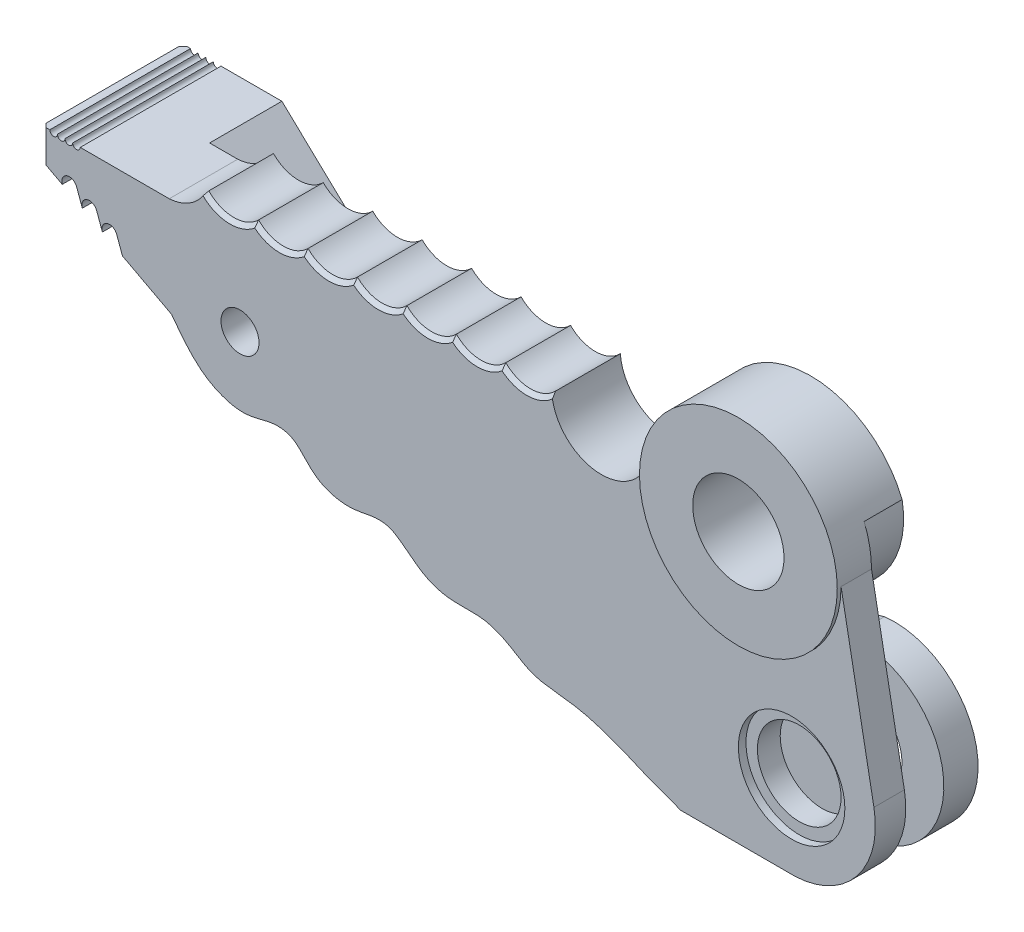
from build123d import *
from build123d.topology import SkipClean

# Parameters (mm, degrees)
BOSS_EXTRU_1_DEPTH         = 18
BOSS_EXTRU_1_DEPTH_BACK    = 19
ESQUISSE1_R                = 12
ESQUISSE1_R_2              = 11
ESQUISSE2_R                = 5
ENL_V_MAT_EXTRU_1_DEPTH    = 202.019899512
ENL_V_MAT_EXTRU_2_DEPTH    = 202.019899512
ESQUISSE5_R                = 1
ENL_V_MAT_EXTRU_3_DEPTH    = 202.019899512
R_P_TITION_LIN_AIRE1_COUNT = 4
R_P_TITION_LIN_AIRE1_PITCH = 2
CHANFREIN1_SIZE            = 1
ENL_V_MAT_EXTRU_4_DEPTH    = 10
CONG_1_R                   = 2
ENL_V_MAT_EXTRU_6_DEPTH    = 10
ENL_V_MAT_EXTRU_7_DEPTH    = 10
CONG_4_R                   = 2
ENL_V_MAT_EXTRU_8_DEPTH    = 9
BOSS_EXTRU_2_DEPTH         = 18
CHANFREIN2_SIZE            = 1
ENL_V_MAT_EXTRU_9_DEPTH    = 9
CONG_6_R                   = 2
ESQUISSE17_R               = 26
ESQUISSE17_R_2             = 12
BOSS_EXTRU_5_DEPTH         = 1
ESQUISSE19_R               = 14
ENL_V_MAT_EXTRU_11_DEPTH   = 2
BOSS_EXTRU_6_DEPTH         = 17
ENL_V_MAT_EXTRU_12_DEPTH   = 18


with BuildPart() as part:
    # Esquisse1 → Boss.-Extru.1 (new, two sides: drawn at the far end of the back side and taken through both)
    with BuildSketch(Plane.XY.offset(-BOSS_EXTRU_1_DEPTH_BACK)):
        with BuildLine():
            Line((-184, 0), (-184, -8))
            Line((-184, -8), (-150, -26))
            Line((-150, -26), (-24, -69))
            Line((-24, -69), (-16.131147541, -72))
            Line((-16.131147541, -72), (13.868852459, -72))
            ThreePointArc((13.868852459, -72), (30.220318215, -63.719167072), (34.63783782, -45.930739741))
            Line((34.63783782, -45.930739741), (26, 0))
            ThreePointArc((26, 0), (0, 26), (-26, 0))
            ThreePointArc((-26, 0), (-37, -6), (-48, 0))
            Line((-48, 0), (-184, 0))
        make_face()
        Circle(ESQUISSE1_R, mode=Mode.SUBTRACT)
        with Locations((13, -50)):
            Circle(ESQUISSE1_R_2, mode=Mode.SUBTRACT)
    extrude(amount=BOSS_EXTRU_1_DEPTH + BOSS_EXTRU_1_DEPTH_BACK)

    # Esquisse2 → Enl_v. mat.-Extru.1 (cut, through all)
    with BuildSketch(Plane.XY.offset(18)):
        with Locations((-132, -21)):
            Circle(ESQUISSE2_R)
    extrude(amount=-ENL_V_MAT_EXTRU_1_DEPTH, mode=Mode.SUBTRACT)

    # Esquisse3 → Enl_v. mat.-Extru.2 (cut, through all)
    with BuildSketch(Plane.XY.offset(18)):
        with BuildLine():
            Line((-177.398811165, -14.441399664), (-178.72728971, -10.791434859))
            ThreePointArc((-178.72728971, -10.791434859), (-177.531944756, -8.228009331), (-174.968519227, -9.423354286))
            Line((-174.968519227, -9.423354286), (-173.454579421, -13.582869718))
            ThreePointArc((-173.454579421, -13.582869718), (-172.259234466, -11.01944419), (-169.695808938, -12.214789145))
            Line((-169.695808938, -12.214789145), (-168.181869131, -16.374304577))
            ThreePointArc((-168.181869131, -16.374304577), (-166.986524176, -13.810879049), (-164.423098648, -15.006224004))
            Line((-164.423098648, -15.006224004), (-162.016838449, -21.617369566))
            Line((-162.016838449, -21.617369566), (-177.398811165, -14.441399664))
        make_face()
    extrude(amount=-ENL_V_MAT_EXTRU_2_DEPTH, mode=Mode.SUBTRACT)

    # Esquisse5 → Enl_v. mat.-Extru.3 (cut, through all)
    with BuildSketch(Plane.XY.offset(18)):
        with Locations((-181, 0)):
            Circle(ESQUISSE5_R)
    enl_v_mat_extru_3 = extrude(amount=-ENL_V_MAT_EXTRU_3_DEPTH, mode=Mode.SUBTRACT)

    # R_p_tition lin_aire1: Enl_v. mat.-Extru.3 ×4
    with Locations(*[(i * R_P_TITION_LIN_AIRE1_PITCH, 0, 0) for i in range(1, R_P_TITION_LIN_AIRE1_COUNT)]):
        add(enl_v_mat_extru_3, mode=Mode.SUBTRACT)

    # Chanfrein1
    chanfrein1_edges = [part.edges().sort_by_distance(p)[0] for p in [
        (-184, -4, 18),
        (-184, -4, -19),
    ]]
    chamfer(chanfrein1_edges, length=CHANFREIN1_SIZE)

    # Esquisse7 → Enl_v. mat.-Extru.4 (cut)
    with BuildSketch(Plane(origin=(0, 0, -19), x_dir=(-1, 0, 0), z_dir=(0, 0, -1))):
        Polygon((-77.310735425, 50.909489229), (158, 50.909489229), (158, 0), (140, -17), (158, -80.260958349), (-77.310735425, -80.260958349), align=None)
    extrude(amount=-ENL_V_MAT_EXTRU_4_DEPTH, mode=Mode.SUBTRACT)

    # Cong_1
    cong_1_edges = [part.edges().sort_by_distance(p)[0] for p in [
        (-143.219254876, -28.314063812, -14),
    ]]
    fillet(cong_1_edges, radius=CONG_1_R)

    # Esquisse10 → Enl_v. mat.-Extru.6 (cut)
    with BuildSketch(Plane.XY):
        with BuildLine():
            Line((34.63783782, -45.930739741), (26, 0))
            ThreePointArc((26, 0), (25.510315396, 5.022330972), (24.059707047, 9.855480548))
            ThreePointArc((24.059707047, 9.855480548), (22.317354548, -4.22739515), (12.878917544, -14.823577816))
            ThreePointArc((12.878917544, -14.823577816), (-8.880851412, -39.651590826), (-24, -69))
            Line((-24, -69), (-16.131147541, -72))
            Line((-16.131147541, -72), (13.868852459, -72))
            ThreePointArc((13.868852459, -72), (30.220318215, -63.719167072), (34.63783782, -45.930739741))
        make_face()
    extrude(amount=ENL_V_MAT_EXTRU_6_DEPTH, mode=Mode.SUBTRACT)

    # Esquisse11 → Enl_v. mat.-Extru.7 (cut)
    with BuildSketch(Plane(origin=(0, 0, -9), x_dir=(-1, 0, 0), z_dir=(0, 0, -1))):
        with BuildLine():
            Line((25.444444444, -13), (131.072254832, -13))
            ThreePointArc((131.072254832, -13), (137.13965314, -15.472403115), (141.059180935, -20.722488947))
            Line((141.059180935, -20.722488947), (142.642872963, -26.288370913))
            ThreePointArc((142.642872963, -26.288370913), (143.638784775, -27.512834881), (145.212478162, -27.633836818))
            Line((145.212478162, -27.633836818), (31.386576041, -66.479184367))
            Line((31.386576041, -66.479184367), (25.444444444, -13))
        make_face()
    extrude(amount=-ENL_V_MAT_EXTRU_7_DEPTH, mode=Mode.SUBTRACT)

    # Cong_4
    cong_4_edges = [part.edges().sort_by_distance(p)[0] for p in [
        (-31.386576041, -66.479184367, -4),
        (-25.444444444, -13, -4),
    ]]
    fillet(cong_4_edges, radius=CONG_4_R)

    # Esquisse12 → Enl_v. mat.-Extru.8 (cut)
    with BuildSketch(Plane(origin=(0, 0, -9), x_dir=(-1, 0, 0), z_dir=(0, 0, -1))):
        with BuildLine():
            Line((141.059180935, -20.722488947), (140, -17))
            Line((140, -17), (158, 0))
            Line((158, 0), (48, 0))
            ThreePointArc((48, 0), (37, -6), (26, 0))
            ThreePointArc((26, 0), (25.126547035, 6.682561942), (22.5648743, 12.916131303))
            Line((22.5648743, 12.916131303), (25.691207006, -15.220863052))
            ThreePointArc((25.691207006, -15.220863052), (26.188718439, -13.666157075), (27.678974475, -13))
            Line((27.678974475, -13), (131.072254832, -13))
            ThreePointArc((131.072254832, -13), (137.13965314, -15.472403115), (141.059180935, -20.722488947))
        make_face()
    extrude(amount=-ENL_V_MAT_EXTRU_8_DEPTH, mode=Mode.SUBTRACT)

    # Esquisse13 → Boss.-Extru.2 (add)
    with BuildSketch(Plane.XY):
        with BuildLine():
            Line((-48, 0), (-150.600687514, 0))
            ThreePointArc((-150.600687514, 0), (-145.122965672, 1.782018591), (-141.2, 6))
            ThreePointArc((-141.2, 6), (-134.676871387, 3.214179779), (-128.119202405, 5.917692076))
            ThreePointArc((-128.119202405, 5.917692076), (-121.619202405, 3.213998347), (-115.119202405, 5.917692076))
            ThreePointArc((-115.119202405, 5.917692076), (-108.619202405, 3.213998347), (-102.119202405, 5.917692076))
            ThreePointArc((-102.119202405, 5.917692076), (-95.619202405, 3.213998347), (-89.119202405, 5.917692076))
            ThreePointArc((-89.119202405, 5.917692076), (-82.619202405, 3.213998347), (-76.119202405, 5.917692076))
            ThreePointArc((-76.119202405, 5.917692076), (-69.619202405, 3.213998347), (-63.119202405, 5.917692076))
            ThreePointArc((-63.119202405, 5.917692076), (-56.561533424, 3.214179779), (-50.03840481, 6))
            ThreePointArc((-50.03840481, 6), (-49.387946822, 2.874724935), (-48, 0))
        make_face()
    extrude(amount=BOSS_EXTRU_2_DEPTH)

    # Chanfrein2
    chanfrein2_edges = [part.edges().sort_by_distance(p)[0] for p in [
        (-56.561533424, 3.214179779, 18),
        (-134.676871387, 3.214179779, 18),
        (-121.619202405, 3.213998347, 18),
        (-108.619202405, 3.213998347, 18),
        (-95.619202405, 3.213998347, 18),
        (-82.619202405, 3.213998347, 18),
        (-69.619202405, 3.213998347, 18),
    ]]
    chamfer(chanfrein2_edges, length=CHANFREIN2_SIZE)

    # Esquisse14 → Enl_v. mat.-Extru.9 (cut)
    with SkipClean():  # the faces are left unmerged after this step: merging them gives an invalid solid
        with BuildSketch(Plane(origin=(0, 0, -9), x_dir=(-1, 0, 0), z_dir=(0, 0, -1))):
            with BuildLine():
                Line((-34.63783782, -45.930739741), (-28.01710807, -10.725747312))
                ThreePointArc((-28.01710807, -10.725747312), (21.093943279, 21.331796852), (-10.410935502, -28.135607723))
                ThreePointArc((-10.410935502, -28.135607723), (-26.033826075, -32.255302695), (-34.63783782, -45.930739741))
            make_face()
        extrude(amount=-ENL_V_MAT_EXTRU_9_DEPTH, mode=Mode.SUBTRACT)

    # Cong_6
    cong_6_edges = [part.edges().sort_by_distance(p)[0] for p in [
        (-25.716516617, -15.448649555, -4.5),
    ]]
    fillet(cong_6_edges, radius=CONG_6_R)

    # Esquisse17 → Boss.-Extru.5 (add)
    with SkipClean():  # the faces are left unmerged after this step: merging them gives an invalid solid
        with BuildSketch(Plane.XY.offset(18)):
            Circle(ESQUISSE17_R)
            Circle(ESQUISSE17_R_2, mode=Mode.SUBTRACT)
        extrude(amount=BOSS_EXTRU_5_DEPTH)

    # Esquisse19 → Enl_v. mat.-Extru.11 (cut)
    with SkipClean():  # the faces are left unmerged after this step: merging them gives an invalid solid
        with BuildSketch(Plane.XY.offset(18)):
            with Locations((13, -50)):
                Circle(ESQUISSE19_R)
        extrude(amount=-ENL_V_MAT_EXTRU_11_DEPTH, mode=Mode.SUBTRACT)

    # Esquisse20 → Boss.-Extru.6 (add)
    with SkipClean():  # the faces are left unmerged after this step: merging them gives an invalid solid
        with BuildSketch(Plane.XY.offset(18)):
            with BuildLine():
                Line((-150, -26), (-44.033291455, -62.163241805))
                add(Edge.make_bspline(
                    [(-150, -26), (-145.454915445, -32.316124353), (-141.09373987, -36.820001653), (-129.072627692, -40.036515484), (-124.862609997, -36.754544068), (-116.113323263, -38.379717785), (-113.655607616, -44.365652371), (-101.843433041, -47.520835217), (-97.442189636, -44.786761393), (-90.267042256, -46.387071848), (-85.222847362, -51.917889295), (-75.581836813, -55.036794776), (-70.110877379, -53.508906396), (-61.186709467, -56.455134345), (-57.604315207, -59.640246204), (-51.523445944, -61.406995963), (-47.778410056, -61.568270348), (-44.033291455, -62.163241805)],
                    knots=[0, 0, 0, 0, 0.126657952, 0.155417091, 0.272905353, 0.299749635, 0.397015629, 0.421976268, 0.524395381, 0.546502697, 0.620942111, 0.641372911, 0.730379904, 0.751623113, 0.832561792, 0.850027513, 0.916162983, 0.916162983, 0.916162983, 0.916162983], degree=3))
            make_face()
        extrude(amount=-BOSS_EXTRU_6_DEPTH)

    # Esquisse21 → Enl_v. mat.-Extru.12 (cut)
    with SkipClean():  # the faces are left unmerged after this step: merging them gives an invalid solid
        with BuildSketch(Plane.XY):
            with BuildLine():
                Line((-44.033291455, -62.163241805), (-25.260030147, -68.569989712))
                add(Edge.make_bspline(
                    [(-44.033291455, -62.163241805), (-36.912009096, -63.294570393), (-25.260030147, -68.569989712)],
                    knots=[0.916162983, 0.916162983, 0.916162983, 1, 1, 1], degree=2))
            make_face()
        extrude(amount=ENL_V_MAT_EXTRU_12_DEPTH, mode=Mode.SUBTRACT)


solid = part.part
